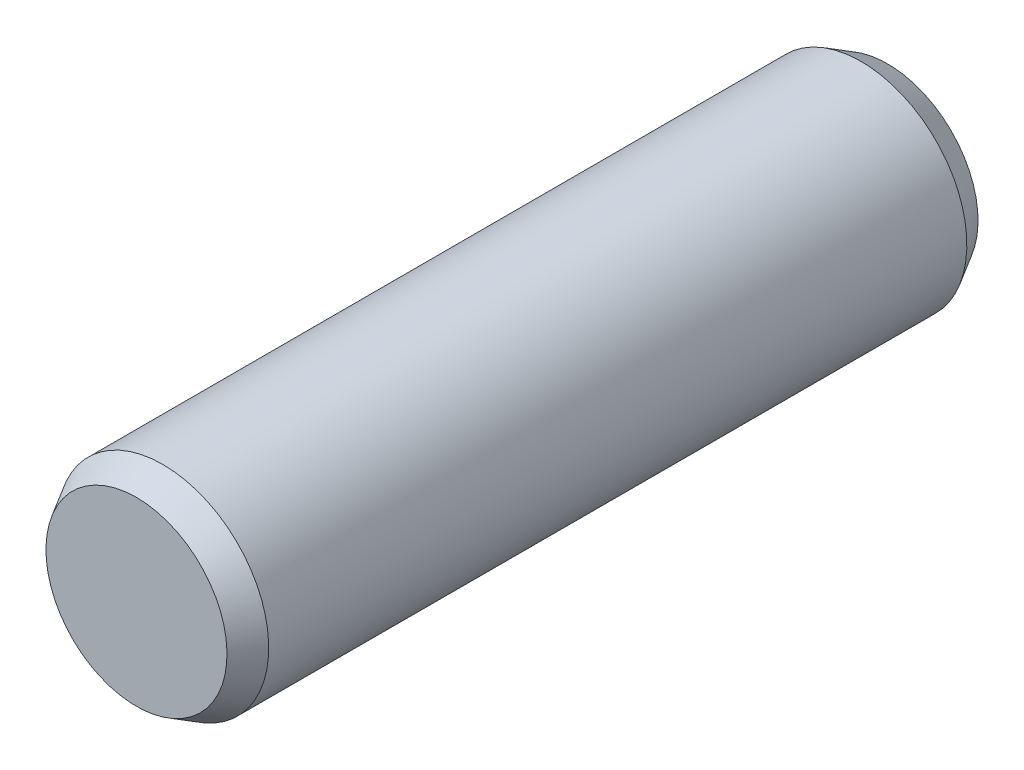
ISO-10303-21;
HEADER;
FILE_DESCRIPTION(('STEP AP214'),'2;1');
FILE_NAME('part.step','',(''),(''),'','','');
FILE_SCHEMA(('AUTOMOTIVE_DESIGN { 1 0 10303 214 1 1 1 1 }'));
ENDSEC;
DATA;
#1=APPLICATION_CONTEXT('core data for automotive mechanical design processes');
#2=APPLICATION_PROTOCOL_DEFINITION('international standard','automotive_design',2000,#1);
#3=PRODUCT_CONTEXT('',#1,'mechanical');
#4=PRODUCT('Part','Part','',(#3));
#5=PRODUCT_RELATED_PRODUCT_CATEGORY('part','',(#4));
#6=PRODUCT_DEFINITION_FORMATION('','',#4);
#7=PRODUCT_DEFINITION_CONTEXT('part definition',#1,'design');
#8=PRODUCT_DEFINITION('design','',#6,#7);
#9=PRODUCT_DEFINITION_SHAPE('','',#8);
#10=(LENGTH_UNIT() NAMED_UNIT(*) SI_UNIT(.MILLI.,.METRE.));
#11=(NAMED_UNIT(*) PLANE_ANGLE_UNIT() SI_UNIT($,.RADIAN.));
#12=(NAMED_UNIT(*) SI_UNIT($,.STERADIAN.) SOLID_ANGLE_UNIT());
#13=UNCERTAINTY_MEASURE_WITH_UNIT(LENGTH_MEASURE(1.E-05),#10,'distance_accuracy_value','');
#14=(GEOMETRIC_REPRESENTATION_CONTEXT(3) GLOBAL_UNCERTAINTY_ASSIGNED_CONTEXT((#13)) GLOBAL_UNIT_ASSIGNED_CONTEXT((#10,
#11,#12)) REPRESENTATION_CONTEXT('',''));
#15=CARTESIAN_POINT('',(0.,0.,0.));
#16=DIRECTION('',(0.,0.,1.));
#17=DIRECTION('',(1.,0.,0.));
#18=AXIS2_PLACEMENT_3D('',#15,#16,#17);
#19=CARTESIAN_POINT('',(-1.731860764,-1.731860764,-7.1));
#20=DIRECTION('',(0.,0.,1.));
#21=DIRECTION('',(1.,0.,0.));
#22=AXIS2_PLACEMENT_3D('',#19,#20,#21);
#23=PLANE('',#22);
#24=CARTESIAN_POINT('',(0.,0.,-7.1));
#25=DIRECTION('',(0.,0.,1.));
#26=DIRECTION('',(0.,-1.,0.));
#27=AXIS2_PLACEMENT_3D('',#24,#25,#26);
#28=CIRCLE('',#27,1.711324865);
#29=CARTESIAN_POINT('',(0.,-1.711324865,-7.1));
#30=VERTEX_POINT('',#29);
#31=EDGE_CURVE('E18',#30,#30,#28,.F.);
#32=ORIENTED_EDGE('',*,*,#31,.T.);
#33=EDGE_LOOP('',(#32));
#34=FACE_BOUND('',#33,.T.);
#35=ADVANCED_FACE('F14',(#34),#23,.F.);
#36=CARTESIAN_POINT('',(0.,0.,-7.1));
#37=DIRECTION('',(0.,0.,1.));
#38=DIRECTION('',(0.,-1.,0.));
#39=AXIS2_PLACEMENT_3D('',#36,#37,#38);
#40=CONICAL_SURFACE('',#39,1.711324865,0.52359877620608);
#41=CARTESIAN_POINT('',(0.,0.,-6.6));
#42=DIRECTION('',(0.,0.,-1.));
#43=DIRECTION('',(-1.,0.,0.));
#44=AXIS2_PLACEMENT_3D('',#41,#42,#43);
#45=CIRCLE('',#44,2.);
#46=CARTESIAN_POINT('',(-2.,0.,-6.6));
#47=VERTEX_POINT('',#46);
#48=EDGE_CURVE('E26',#47,#47,#45,.T.);
#49=ORIENTED_EDGE('',*,*,#48,.T.);
#50=EDGE_LOOP('',(#49));
#51=FACE_BOUND('',#50,.T.);
#52=ORIENTED_EDGE('',*,*,#31,.F.);
#53=EDGE_LOOP('',(#52));
#54=FACE_BOUND('',#53,.T.);
#55=ADVANCED_FACE('F36',(#51,#54),#40,.T.);
#56=CARTESIAN_POINT('',(0.,0.,6.6));
#57=DIRECTION('',(0.,0.,-1.));
#58=DIRECTION('',(0.,1.,0.));
#59=AXIS2_PLACEMENT_3D('',#56,#57,#58);
#60=CYLINDRICAL_SURFACE('',#59,2.);
#61=ORIENTED_EDGE('',*,*,#48,.F.);
#62=EDGE_LOOP('',(#61));
#63=FACE_BOUND('',#62,.T.);
#64=CARTESIAN_POINT('',(0.,0.,6.59999999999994));
#65=DIRECTION('',(0.,0.,-1.));
#66=DIRECTION('',(-1.,0.,0.));
#67=AXIS2_PLACEMENT_3D('',#64,#65,#66);
#68=CIRCLE('',#67,2.);
#69=CARTESIAN_POINT('',(-2.,0.,6.6));
#70=VERTEX_POINT('',#69);
#71=EDGE_CURVE('E22',#70,#70,#68,.T.);
#72=ORIENTED_EDGE('',*,*,#71,.T.);
#73=EDGE_LOOP('',(#72));
#74=FACE_BOUND('',#73,.T.);
#75=ADVANCED_FACE('F38',(#63,#74),#60,.T.);
#76=CARTESIAN_POINT('',(-1.731860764,-1.731860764,7.1));
#77=DIRECTION('',(0.,0.,1.));
#78=DIRECTION('',(1.,0.,0.));
#79=AXIS2_PLACEMENT_3D('',#76,#77,#78);
#80=PLANE('',#79);
#81=CARTESIAN_POINT('',(0.,0.,7.10000000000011));
#82=DIRECTION('',(0.,0.,-1.));
#83=DIRECTION('',(0.,1.,0.));
#84=AXIS2_PLACEMENT_3D('',#81,#82,#83);
#85=CIRCLE('',#84,1.71132486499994);
#86=CARTESIAN_POINT('',(0.,1.71132486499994,7.10000000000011));
#87=VERTEX_POINT('',#86);
#88=EDGE_CURVE('E10',#87,#87,#85,.F.);
#89=ORIENTED_EDGE('',*,*,#88,.T.);
#90=EDGE_LOOP('',(#89));
#91=FACE_BOUND('',#90,.T.);
#92=ADVANCED_FACE('F16',(#91),#80,.T.);
#93=CARTESIAN_POINT('',(0.,0.,7.1));
#94=DIRECTION('',(0.,0.,-1.));
#95=DIRECTION('',(0.,1.,0.));
#96=AXIS2_PLACEMENT_3D('',#93,#94,#95);
#97=CONICAL_SURFACE('',#96,1.711324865,0.52359877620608);
#98=ORIENTED_EDGE('',*,*,#88,.F.);
#99=EDGE_LOOP('',(#98));
#100=FACE_BOUND('',#99,.T.);
#101=ORIENTED_EDGE('',*,*,#71,.F.);
#102=EDGE_LOOP('',(#101));
#103=FACE_BOUND('',#102,.T.);
#104=ADVANCED_FACE('F47',(#100,#103),#97,.T.);
#105=CLOSED_SHELL('',(#35,#55,#75,#92,#104));
#106=MANIFOLD_SOLID_BREP('B1',#105);
#107=ADVANCED_BREP_SHAPE_REPRESENTATION('',(#18,#106),#14);
#108=SHAPE_DEFINITION_REPRESENTATION(#9,#107);
ENDSEC;
END-ISO-10303-21;
